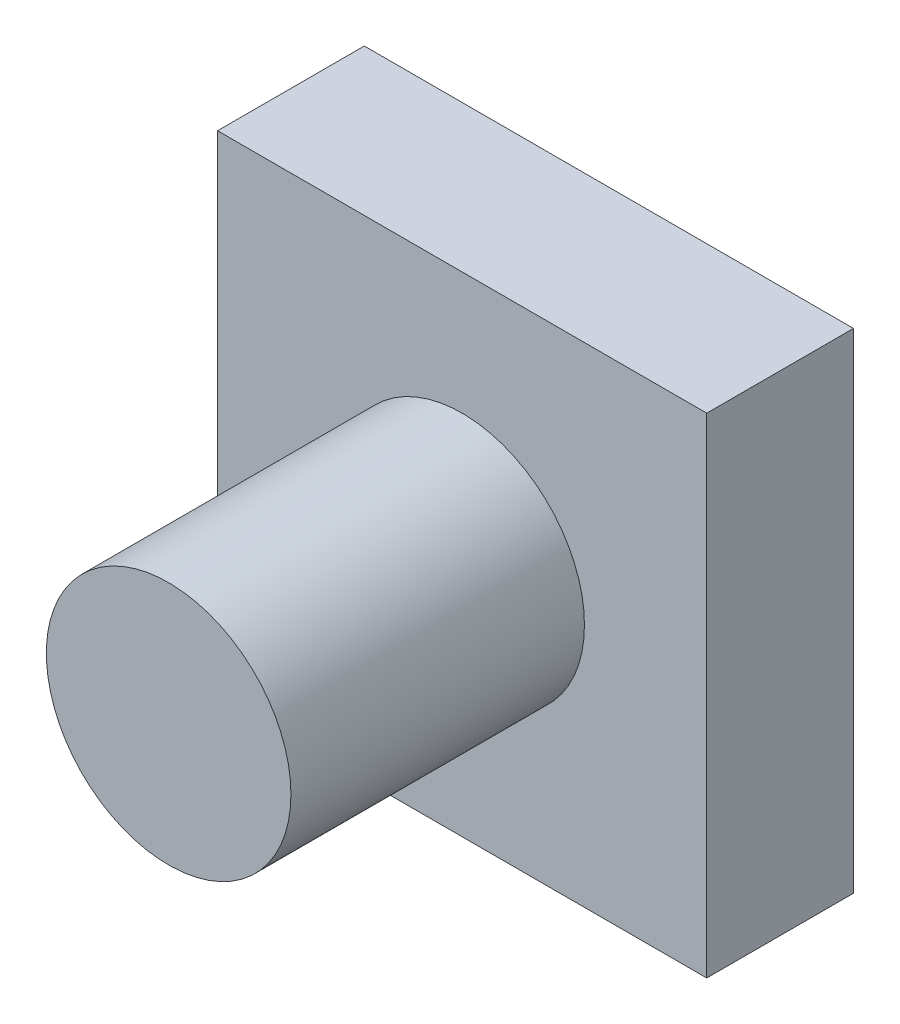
ISO-10303-21;
HEADER;
FILE_DESCRIPTION(('STEP AP214'),'2;1');
FILE_NAME('part.step','',(''),(''),'','','');
FILE_SCHEMA(('AUTOMOTIVE_DESIGN { 1 0 10303 214 1 1 1 1 }'));
ENDSEC;
DATA;
#1=APPLICATION_CONTEXT('core data for automotive mechanical design processes');
#2=APPLICATION_PROTOCOL_DEFINITION('international standard','automotive_design',2000,#1);
#3=PRODUCT_CONTEXT('',#1,'mechanical');
#4=PRODUCT('Part','Part','',(#3));
#5=PRODUCT_RELATED_PRODUCT_CATEGORY('part','',(#4));
#6=PRODUCT_DEFINITION_FORMATION('','',#4);
#7=PRODUCT_DEFINITION_CONTEXT('part definition',#1,'design');
#8=PRODUCT_DEFINITION('design','',#6,#7);
#9=PRODUCT_DEFINITION_SHAPE('','',#8);
#10=(LENGTH_UNIT() NAMED_UNIT(*) SI_UNIT(.MILLI.,.METRE.));
#11=(NAMED_UNIT(*) PLANE_ANGLE_UNIT() SI_UNIT($,.RADIAN.));
#12=(NAMED_UNIT(*) SI_UNIT($,.STERADIAN.) SOLID_ANGLE_UNIT());
#13=UNCERTAINTY_MEASURE_WITH_UNIT(LENGTH_MEASURE(1.E-05),#10,'distance_accuracy_value','');
#14=(GEOMETRIC_REPRESENTATION_CONTEXT(3) GLOBAL_UNCERTAINTY_ASSIGNED_CONTEXT((#13)) GLOBAL_UNIT_ASSIGNED_CONTEXT((#10,
#11,#12)) REPRESENTATION_CONTEXT('',''));
#15=CARTESIAN_POINT('',(0.,0.,0.));
#16=DIRECTION('',(0.,0.,1.));
#17=DIRECTION('',(1.,0.,0.));
#18=AXIS2_PLACEMENT_3D('',#15,#16,#17);
#19=CARTESIAN_POINT('',(-250.,250.,150.));
#20=DIRECTION('',(1.,0.,0.));
#21=DIRECTION('',(0.,1.,0.));
#22=AXIS2_PLACEMENT_3D('',#19,#20,#21);
#23=PLANE('',#22);
#24=DIRECTION('',(0.,-1.,0.));
#25=VECTOR('',#24,1.);
#26=CARTESIAN_POINT('',(-250.,250.,0.));
#27=LINE('',#26,#25);
#28=CARTESIAN_POINT('',(-250.,250.,0.));
#29=VERTEX_POINT('',#28);
#30=CARTESIAN_POINT('',(-250.,-250.,0.));
#31=VERTEX_POINT('',#30);
#32=EDGE_CURVE('E100',#29,#31,#27,.T.);
#33=ORIENTED_EDGE('',*,*,#32,.T.);
#34=DIRECTION('',(0.,0.,-1.));
#35=VECTOR('',#34,1.);
#36=CARTESIAN_POINT('',(-250.,-250.,150.));
#37=LINE('',#36,#35);
#38=CARTESIAN_POINT('',(-250.,-250.,150.));
#39=VERTEX_POINT('',#38);
#40=EDGE_CURVE('E37',#39,#31,#37,.T.);
#41=ORIENTED_EDGE('',*,*,#40,.F.);
#42=DIRECTION('',(0.,-1.,0.));
#43=VECTOR('',#42,1.);
#44=CARTESIAN_POINT('',(-250.,250.,150.));
#45=LINE('',#44,#43);
#46=CARTESIAN_POINT('',(-250.,250.,150.));
#47=VERTEX_POINT('',#46);
#48=EDGE_CURVE('E87',#47,#39,#45,.T.);
#49=ORIENTED_EDGE('',*,*,#48,.F.);
#50=DIRECTION('',(0.,0.,-1.));
#51=VECTOR('',#50,1.);
#52=CARTESIAN_POINT('',(-250.,250.,150.));
#53=LINE('',#52,#51);
#54=EDGE_CURVE('E96',#47,#29,#53,.T.);
#55=ORIENTED_EDGE('',*,*,#54,.T.);
#56=EDGE_LOOP('',(#33,#41,#49,#55));
#57=FACE_BOUND('',#56,.T.);
#58=ADVANCED_FACE('F34',(#57),#23,.F.);
#59=CARTESIAN_POINT('',(-250.,-250.,150.));
#60=DIRECTION('',(0.,1.,0.));
#61=DIRECTION('',(0.,0.,1.));
#62=AXIS2_PLACEMENT_3D('',#59,#60,#61);
#63=PLANE('',#62);
#64=DIRECTION('',(1.,0.,0.));
#65=VECTOR('',#64,1.);
#66=CARTESIAN_POINT('',(-250.,-250.,0.));
#67=LINE('',#66,#65);
#68=CARTESIAN_POINT('',(250.,-250.,0.));
#69=VERTEX_POINT('',#68);
#70=EDGE_CURVE('E92',#31,#69,#67,.T.);
#71=ORIENTED_EDGE('',*,*,#70,.T.);
#72=DIRECTION('',(0.,0.,-1.));
#73=VECTOR('',#72,1.);
#74=CARTESIAN_POINT('',(250.,-250.,150.));
#75=LINE('',#74,#73);
#76=CARTESIAN_POINT('',(250.,-250.,150.));
#77=VERTEX_POINT('',#76);
#78=EDGE_CURVE('E90',#77,#69,#75,.T.);
#79=ORIENTED_EDGE('',*,*,#78,.F.);
#80=DIRECTION('',(1.,0.,0.));
#81=VECTOR('',#80,1.);
#82=CARTESIAN_POINT('',(-250.,-250.,150.));
#83=LINE('',#82,#81);
#84=EDGE_CURVE('E82',#39,#77,#83,.T.);
#85=ORIENTED_EDGE('',*,*,#84,.F.);
#86=ORIENTED_EDGE('',*,*,#40,.T.);
#87=EDGE_LOOP('',(#71,#79,#85,#86));
#88=FACE_BOUND('',#87,.T.);
#89=ADVANCED_FACE('F91',(#88),#63,.F.);
#90=CARTESIAN_POINT('',(250.,250.,150.));
#91=DIRECTION('',(-1.,0.,0.));
#92=DIRECTION('',(0.,-1.,0.));
#93=AXIS2_PLACEMENT_3D('',#90,#91,#92);
#94=PLANE('',#93);
#95=DIRECTION('',(0.,1.,0.));
#96=VECTOR('',#95,1.);
#97=CARTESIAN_POINT('',(250.,250.,0.));
#98=LINE('',#97,#96);
#99=CARTESIAN_POINT('',(250.,250.,0.));
#100=VERTEX_POINT('',#99);
#101=EDGE_CURVE('E68',#69,#100,#98,.T.);
#102=ORIENTED_EDGE('',*,*,#101,.T.);
#103=DIRECTION('',(0.,0.,-1.));
#104=VECTOR('',#103,1.);
#105=CARTESIAN_POINT('',(250.,250.,150.));
#106=LINE('',#105,#104);
#107=CARTESIAN_POINT('',(250.,250.,150.));
#108=VERTEX_POINT('',#107);
#109=EDGE_CURVE('E93',#108,#100,#106,.T.);
#110=ORIENTED_EDGE('',*,*,#109,.F.);
#111=DIRECTION('',(0.,1.,0.));
#112=VECTOR('',#111,1.);
#113=CARTESIAN_POINT('',(250.,250.,150.));
#114=LINE('',#113,#112);
#115=EDGE_CURVE('E85',#77,#108,#114,.T.);
#116=ORIENTED_EDGE('',*,*,#115,.F.);
#117=ORIENTED_EDGE('',*,*,#78,.T.);
#118=EDGE_LOOP('',(#102,#110,#116,#117));
#119=FACE_BOUND('',#118,.T.);
#120=ADVANCED_FACE('F94',(#119),#94,.F.);
#121=CARTESIAN_POINT('',(-250.,250.,150.));
#122=DIRECTION('',(0.,-1.,0.));
#123=DIRECTION('',(0.,0.,-1.));
#124=AXIS2_PLACEMENT_3D('',#121,#122,#123);
#125=PLANE('',#124);
#126=DIRECTION('',(-1.,0.,0.));
#127=VECTOR('',#126,1.);
#128=CARTESIAN_POINT('',(-250.,250.,0.));
#129=LINE('',#128,#127);
#130=EDGE_CURVE('E74',#100,#29,#129,.T.);
#131=ORIENTED_EDGE('',*,*,#130,.T.);
#132=ORIENTED_EDGE('',*,*,#54,.F.);
#133=DIRECTION('',(-1.,0.,0.));
#134=VECTOR('',#133,1.);
#135=CARTESIAN_POINT('',(-250.,250.,150.));
#136=LINE('',#135,#134);
#137=EDGE_CURVE('E51',#108,#47,#136,.T.);
#138=ORIENTED_EDGE('',*,*,#137,.F.);
#139=ORIENTED_EDGE('',*,*,#109,.T.);
#140=EDGE_LOOP('',(#131,#132,#138,#139));
#141=FACE_BOUND('',#140,.T.);
#142=ADVANCED_FACE('F108',(#141),#125,.F.);
#143=CARTESIAN_POINT('',(0.,0.,150.));
#144=DIRECTION('',(0.,0.,1.));
#145=DIRECTION('',(1.,0.,0.));
#146=AXIS2_PLACEMENT_3D('',#143,#144,#145);
#147=PLANE('',#146);
#148=CARTESIAN_POINT('',(0.,0.,150.));
#149=DIRECTION('',(0.,0.,1.));
#150=DIRECTION('',(1.,0.,0.));
#151=AXIS2_PLACEMENT_3D('',#148,#149,#150);
#152=CIRCLE('',#151,125.);
#153=CARTESIAN_POINT('',(125.,0.,150.));
#154=VERTEX_POINT('',#153);
#155=EDGE_CURVE('E11',#154,#154,#152,.T.);
#156=ORIENTED_EDGE('',*,*,#155,.F.);
#157=EDGE_LOOP('',(#156));
#158=FACE_BOUND('',#157,.T.);
#159=ORIENTED_EDGE('',*,*,#48,.T.);
#160=ORIENTED_EDGE('',*,*,#84,.T.);
#161=ORIENTED_EDGE('',*,*,#115,.T.);
#162=ORIENTED_EDGE('',*,*,#137,.T.);
#163=EDGE_LOOP('',(#159,#160,#161,#162));
#164=FACE_BOUND('',#163,.T.);
#165=ADVANCED_FACE('F83',(#158,#164),#147,.T.);
#166=CARTESIAN_POINT('',(0.,0.,0.));
#167=DIRECTION('',(0.,0.,1.));
#168=DIRECTION('',(1.,0.,0.));
#169=AXIS2_PLACEMENT_3D('',#166,#167,#168);
#170=PLANE('',#169);
#171=ORIENTED_EDGE('',*,*,#32,.F.);
#172=ORIENTED_EDGE('',*,*,#130,.F.);
#173=ORIENTED_EDGE('',*,*,#101,.F.);
#174=ORIENTED_EDGE('',*,*,#70,.F.);
#175=EDGE_LOOP('',(#171,#172,#173,#174));
#176=FACE_BOUND('',#175,.T.);
#177=ADVANCED_FACE('F111',(#176),#170,.F.);
#178=CARTESIAN_POINT('',(0.,0.,450.));
#179=DIRECTION('',(0.,0.,-1.));
#180=DIRECTION('',(-1.,0.,0.));
#181=AXIS2_PLACEMENT_3D('',#178,#179,#180);
#182=CYLINDRICAL_SURFACE('',#181,125.);
#183=CARTESIAN_POINT('',(0.,0.,450.));
#184=DIRECTION('',(0.,0.,1.));
#185=DIRECTION('',(1.,0.,0.));
#186=AXIS2_PLACEMENT_3D('',#183,#184,#185);
#187=CIRCLE('',#186,125.);
#188=CARTESIAN_POINT('',(125.,0.,450.));
#189=VERTEX_POINT('',#188);
#190=EDGE_CURVE('E103',#189,#189,#187,.T.);
#191=ORIENTED_EDGE('',*,*,#190,.F.);
#192=EDGE_LOOP('',(#191));
#193=FACE_BOUND('',#192,.T.);
#194=ORIENTED_EDGE('',*,*,#155,.T.);
#195=EDGE_LOOP('',(#194));
#196=FACE_BOUND('',#195,.T.);
#197=ADVANCED_FACE('F119',(#193,#196),#182,.T.);
#198=CARTESIAN_POINT('',(0.,0.,450.));
#199=DIRECTION('',(0.,0.,1.));
#200=DIRECTION('',(1.,0.,0.));
#201=AXIS2_PLACEMENT_3D('',#198,#199,#200);
#202=PLANE('',#201);
#203=ORIENTED_EDGE('',*,*,#190,.T.);
#204=EDGE_LOOP('',(#203));
#205=FACE_BOUND('',#204,.T.);
#206=ADVANCED_FACE('F117',(#205),#202,.T.);
#207=CLOSED_SHELL('',(#58,#89,#120,#142,#165,#177,#197,#206));
#208=MANIFOLD_SOLID_BREP('B2',#207);
#209=ADVANCED_BREP_SHAPE_REPRESENTATION('',(#18,#208),#14);
#210=SHAPE_DEFINITION_REPRESENTATION(#9,#209);
ENDSEC;
END-ISO-10303-21;
